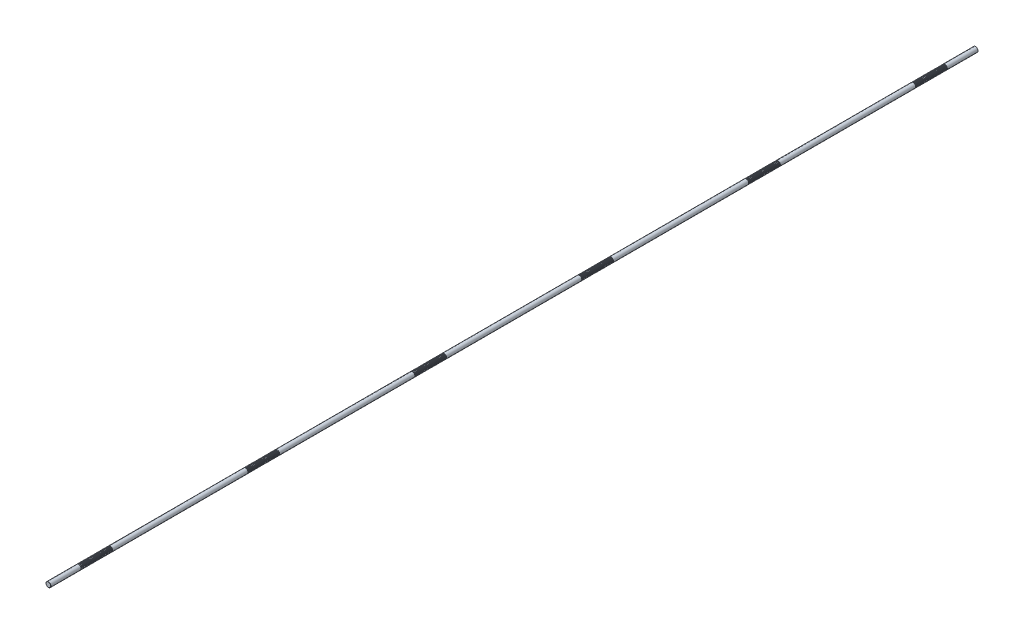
from build123d import *

# Parameters (mm, degrees)
SKETCH1_R           = 8
BOSS_EXTRUDE1_DEPTH = 1500
CHAMFER1_SIZE       = 0.4
LPATTERN1_COUNT     = 26
LPATTERN1_PITCH     = 4
LPATTERN2_COUNT     = 6
LPATTERN2_PITCH     = 540


with BuildPart() as part:
    # Sketch1 → Boss-Extrude1 (new, symmetric)
    with BuildSketch(Plane.XY):
        Circle(SKETCH1_R)
    extrude(amount=BOSS_EXTRUDE1_DEPTH, both=True)

    # Chamfer1
    chamfer1_edges = [part.edges().sort_by_distance(p)[0] for p in [
        (-8, 0, -1500),
        (-8, 0, 1500),
    ]]
    chamfer(chamfer1_edges, length=CHAMFER1_SIZE)

    # Sketch2 → Cut-Revolve1 (revolve, cut)
    with BuildSketch(Plane(origin=(0, 0, 0), x_dir=(0, 0, -1), z_dir=(1, 0, 0)), mode=Mode.PRIVATE) as cut_revolve1_sk:
        Polygon((1400.301442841, 8), (1397.698557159, 8), (1398.301442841, 5.75), (1399.698557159, 5.75), align=None)
    cut_revolve1 = revolve(cut_revolve1_sk.sketch.rotate(Axis((0, 0, 1500), (0, 0, -1)), 90), axis=Axis((0, 0, 1500), (0, 0, -1)), mode=Mode.SUBTRACT)

    # LPattern1: Cut-Revolve1 ×26
    with Locations(*[(0, 0, i * LPATTERN1_PITCH) for i in range(1, LPATTERN1_COUNT)]):
        add(cut_revolve1, mode=Mode.SUBTRACT)

    # LPattern2: Cut-Revolve1 ×6
    with Locations(*[(0, 0, i * LPATTERN2_PITCH) for i in range(1, LPATTERN2_COUNT)]):
        add(cut_revolve1, mode=Mode.SUBTRACT)

    # LPattern2 copy 1 sketch → LPattern2 copy 1 (revolve, cut)
    with BuildSketch(Plane(origin=(0, 0, 544), x_dir=(0, 0, -1), z_dir=(1, 0, 0))):
        Polygon((1400.301442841, 8), (1397.698557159, 8), (1398.301442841, 5.75), (1399.698557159, 5.75), align=None)
    revolve(axis=Axis((0, 0, 2044), (0, 0, -1)), mode=Mode.SUBTRACT)

    # LPattern2 copy 2 sketch → LPattern2 copy 2 (revolve, cut)
    with BuildSketch(Plane(origin=(0, 0, 1084), x_dir=(0, 0, -1), z_dir=(1, 0, 0))):
        Polygon((1400.301442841, 8), (1397.698557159, 8), (1398.301442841, 5.75), (1399.698557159, 5.75), align=None)
    revolve(axis=Axis((0, 0, 2584), (0, 0, -1)), mode=Mode.SUBTRACT)

    # LPattern2 copy 3 sketch → LPattern2 copy 3 (revolve, cut)
    with BuildSketch(Plane(origin=(0, 0, 1624), x_dir=(0, 0, -1), z_dir=(1, 0, 0))):
        Polygon((1400.301442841, 8), (1397.698557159, 8), (1398.301442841, 5.75), (1399.698557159, 5.75), align=None)
    revolve(axis=Axis((0, 0, 3124), (0, 0, -1)), mode=Mode.SUBTRACT)

    # LPattern2 copy 4 sketch → LPattern2 copy 4 (revolve, cut)
    with BuildSketch(Plane(origin=(0, 0, 2164), x_dir=(0, 0, -1), z_dir=(1, 0, 0))):
        Polygon((1400.301442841, 8), (1397.698557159, 8), (1398.301442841, 5.75), (1399.698557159, 5.75), align=None)
    revolve(axis=Axis((0, 0, 3664), (0, 0, -1)), mode=Mode.SUBTRACT)

    # LPattern2 copy 5 sketch → LPattern2 copy 5 (revolve, cut)
    with BuildSketch(Plane(origin=(0, 0, 2704), x_dir=(0, 0, -1), z_dir=(1, 0, 0))):
        Polygon((1400.301442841, 8), (1397.698557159, 8), (1398.301442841, 5.75), (1399.698557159, 5.75), align=None)
    revolve(axis=Axis((0, 0, 4204), (0, 0, -1)), mode=Mode.SUBTRACT)

    # LPattern2 copy 6 sketch → LPattern2 copy 6 (revolve, cut)
    with BuildSketch(Plane(origin=(0, 0, 548), x_dir=(0, 0, -1), z_dir=(1, 0, 0))):
        Polygon((1400.301442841, 8), (1397.698557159, 8), (1398.301442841, 5.75), (1399.698557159, 5.75), align=None)
    revolve(axis=Axis((0, 0, 2048), (0, 0, -1)), mode=Mode.SUBTRACT)

    # LPattern2 copy 7 sketch → LPattern2 copy 7 (revolve, cut)
    with BuildSketch(Plane(origin=(0, 0, 1088), x_dir=(0, 0, -1), z_dir=(1, 0, 0))):
        Polygon((1400.301442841, 8), (1397.698557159, 8), (1398.301442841, 5.75), (1399.698557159, 5.75), align=None)
    revolve(axis=Axis((0, 0, 2588), (0, 0, -1)), mode=Mode.SUBTRACT)

    # LPattern2 copy 8 sketch → LPattern2 copy 8 (revolve, cut)
    with BuildSketch(Plane(origin=(0, 0, 1628), x_dir=(0, 0, -1), z_dir=(1, 0, 0))):
        Polygon((1400.301442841, 8), (1397.698557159, 8), (1398.301442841, 5.75), (1399.698557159, 5.75), align=None)
    revolve(axis=Axis((0, 0, 3128), (0, 0, -1)), mode=Mode.SUBTRACT)

    # LPattern2 copy 9 sketch → LPattern2 copy 9 (revolve, cut)
    with BuildSketch(Plane(origin=(0, 0, 2168), x_dir=(0, 0, -1), z_dir=(1, 0, 0))):
        Polygon((1400.301442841, 8), (1397.698557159, 8), (1398.301442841, 5.75), (1399.698557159, 5.75), align=None)
    revolve(axis=Axis((0, 0, 3668), (0, 0, -1)), mode=Mode.SUBTRACT)

    # LPattern2 copy 10 sketch → LPattern2 copy 10 (revolve, cut)
    with BuildSketch(Plane(origin=(0, 0, 2708), x_dir=(0, 0, -1), z_dir=(1, 0, 0))):
        Polygon((1400.301442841, 8), (1397.698557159, 8), (1398.301442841, 5.75), (1399.698557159, 5.75), align=None)
    revolve(axis=Axis((0, 0, 4208), (0, 0, -1)), mode=Mode.SUBTRACT)

    # LPattern2 copy 11 sketch → LPattern2 copy 11 (revolve, cut)
    with BuildSketch(Plane(origin=(0, 0, 552), x_dir=(0, 0, -1), z_dir=(1, 0, 0))):
        Polygon((1400.301442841, 8), (1397.698557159, 8), (1398.301442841, 5.75), (1399.698557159, 5.75), align=None)
    revolve(axis=Axis((0, 0, 2052), (0, 0, -1)), mode=Mode.SUBTRACT)

    # LPattern2 copy 12 sketch → LPattern2 copy 12 (revolve, cut)
    with BuildSketch(Plane(origin=(0, 0, 1092), x_dir=(0, 0, -1), z_dir=(1, 0, 0))):
        Polygon((1400.301442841, 8), (1397.698557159, 8), (1398.301442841, 5.75), (1399.698557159, 5.75), align=None)
    revolve(axis=Axis((0, 0, 2592), (0, 0, -1)), mode=Mode.SUBTRACT)

    # LPattern2 copy 13 sketch → LPattern2 copy 13 (revolve, cut)
    with BuildSketch(Plane(origin=(0, 0, 1632), x_dir=(0, 0, -1), z_dir=(1, 0, 0))):
        Polygon((1400.301442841, 8), (1397.698557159, 8), (1398.301442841, 5.75), (1399.698557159, 5.75), align=None)
    revolve(axis=Axis((0, 0, 3132), (0, 0, -1)), mode=Mode.SUBTRACT)

    # LPattern2 copy 14 sketch → LPattern2 copy 14 (revolve, cut)
    with BuildSketch(Plane(origin=(0, 0, 2172), x_dir=(0, 0, -1), z_dir=(1, 0, 0))):
        Polygon((1400.301442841, 8), (1397.698557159, 8), (1398.301442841, 5.75), (1399.698557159, 5.75), align=None)
    revolve(axis=Axis((0, 0, 3672), (0, 0, -1)), mode=Mode.SUBTRACT)

    # LPattern2 copy 15 sketch → LPattern2 copy 15 (revolve, cut)
    with BuildSketch(Plane(origin=(0, 0, 2712), x_dir=(0, 0, -1), z_dir=(1, 0, 0))):
        Polygon((1400.301442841, 8), (1397.698557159, 8), (1398.301442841, 5.75), (1399.698557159, 5.75), align=None)
    revolve(axis=Axis((0, 0, 4212), (0, 0, -1)), mode=Mode.SUBTRACT)

    # LPattern2 copy 16 sketch → LPattern2 copy 16 (revolve, cut)
    with BuildSketch(Plane(origin=(0, 0, 556), x_dir=(0, 0, -1), z_dir=(1, 0, 0))):
        Polygon((1400.301442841, 8), (1397.698557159, 8), (1398.301442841, 5.75), (1399.698557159, 5.75), align=None)
    revolve(axis=Axis((0, 0, 2056), (0, 0, -1)), mode=Mode.SUBTRACT)

    # LPattern2 copy 17 sketch → LPattern2 copy 17 (revolve, cut)
    with BuildSketch(Plane(origin=(0, 0, 1096), x_dir=(0, 0, -1), z_dir=(1, 0, 0))):
        Polygon((1400.301442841, 8), (1397.698557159, 8), (1398.301442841, 5.75), (1399.698557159, 5.75), align=None)
    revolve(axis=Axis((0, 0, 2596), (0, 0, -1)), mode=Mode.SUBTRACT)

    # LPattern2 copy 18 sketch → LPattern2 copy 18 (revolve, cut)
    with BuildSketch(Plane(origin=(0, 0, 1636), x_dir=(0, 0, -1), z_dir=(1, 0, 0))):
        Polygon((1400.301442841, 8), (1397.698557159, 8), (1398.301442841, 5.75), (1399.698557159, 5.75), align=None)
    revolve(axis=Axis((0, 0, 3136), (0, 0, -1)), mode=Mode.SUBTRACT)

    # LPattern2 copy 19 sketch → LPattern2 copy 19 (revolve, cut)
    with BuildSketch(Plane(origin=(0, 0, 2176), x_dir=(0, 0, -1), z_dir=(1, 0, 0))):
        Polygon((1400.301442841, 8), (1397.698557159, 8), (1398.301442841, 5.75), (1399.698557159, 5.75), align=None)
    revolve(axis=Axis((0, 0, 3676), (0, 0, -1)), mode=Mode.SUBTRACT)

    # LPattern2 copy 20 sketch → LPattern2 copy 20 (revolve, cut)
    with BuildSketch(Plane(origin=(0, 0, 2716), x_dir=(0, 0, -1), z_dir=(1, 0, 0))):
        Polygon((1400.301442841, 8), (1397.698557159, 8), (1398.301442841, 5.75), (1399.698557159, 5.75), align=None)
    revolve(axis=Axis((0, 0, 4216), (0, 0, -1)), mode=Mode.SUBTRACT)

    # LPattern2 copy 21 sketch → LPattern2 copy 21 (revolve, cut)
    with BuildSketch(Plane(origin=(0, 0, 560), x_dir=(0, 0, -1), z_dir=(1, 0, 0))):
        Polygon((1400.301442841, 8), (1397.698557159, 8), (1398.301442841, 5.75), (1399.698557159, 5.75), align=None)
    revolve(axis=Axis((0, 0, 2060), (0, 0, -1)), mode=Mode.SUBTRACT)

    # LPattern2 copy 22 sketch → LPattern2 copy 22 (revolve, cut)
    with BuildSketch(Plane(origin=(0, 0, 1100), x_dir=(0, 0, -1), z_dir=(1, 0, 0))):
        Polygon((1400.301442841, 8), (1397.698557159, 8), (1398.301442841, 5.75), (1399.698557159, 5.75), align=None)
    revolve(axis=Axis((0, 0, 2600), (0, 0, -1)), mode=Mode.SUBTRACT)

    # LPattern2 copy 23 sketch → LPattern2 copy 23 (revolve, cut)
    with BuildSketch(Plane(origin=(0, 0, 1640), x_dir=(0, 0, -1), z_dir=(1, 0, 0))):
        Polygon((1400.301442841, 8), (1397.698557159, 8), (1398.301442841, 5.75), (1399.698557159, 5.75), align=None)
    revolve(axis=Axis((0, 0, 3140), (0, 0, -1)), mode=Mode.SUBTRACT)

    # LPattern2 copy 24 sketch → LPattern2 copy 24 (revolve, cut)
    with BuildSketch(Plane(origin=(0, 0, 2180), x_dir=(0, 0, -1), z_dir=(1, 0, 0))):
        Polygon((1400.301442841, 8), (1397.698557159, 8), (1398.301442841, 5.75), (1399.698557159, 5.75), align=None)
    revolve(axis=Axis((0, 0, 3680), (0, 0, -1)), mode=Mode.SUBTRACT)

    # LPattern2 copy 25 sketch → LPattern2 copy 25 (revolve, cut)
    with BuildSketch(Plane(origin=(0, 0, 2720), x_dir=(0, 0, -1), z_dir=(1, 0, 0))):
        Polygon((1400.301442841, 8), (1397.698557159, 8), (1398.301442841, 5.75), (1399.698557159, 5.75), align=None)
    revolve(axis=Axis((0, 0, 4220), (0, 0, -1)), mode=Mode.SUBTRACT)

    # LPattern2 copy 26 sketch → LPattern2 copy 26 (revolve, cut)
    with BuildSketch(Plane(origin=(0, 0, 564), x_dir=(0, 0, -1), z_dir=(1, 0, 0))):
        Polygon((1400.301442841, 8), (1397.698557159, 8), (1398.301442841, 5.75), (1399.698557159, 5.75), align=None)
    revolve(axis=Axis((0, 0, 2064), (0, 0, -1)), mode=Mode.SUBTRACT)

    # LPattern2 copy 27 sketch → LPattern2 copy 27 (revolve, cut)
    with BuildSketch(Plane(origin=(0, 0, 1104), x_dir=(0, 0, -1), z_dir=(1, 0, 0))):
        Polygon((1400.301442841, 8), (1397.698557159, 8), (1398.301442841, 5.75), (1399.698557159, 5.75), align=None)
    revolve(axis=Axis((0, 0, 2604), (0, 0, -1)), mode=Mode.SUBTRACT)

    # LPattern2 copy 28 sketch → LPattern2 copy 28 (revolve, cut)
    with BuildSketch(Plane(origin=(0, 0, 1644), x_dir=(0, 0, -1), z_dir=(1, 0, 0))):
        Polygon((1400.301442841, 8), (1397.698557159, 8), (1398.301442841, 5.75), (1399.698557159, 5.75), align=None)
    revolve(axis=Axis((0, 0, 3144), (0, 0, -1)), mode=Mode.SUBTRACT)

    # LPattern2 copy 29 sketch → LPattern2 copy 29 (revolve, cut)
    with BuildSketch(Plane(origin=(0, 0, 2184), x_dir=(0, 0, -1), z_dir=(1, 0, 0))):
        Polygon((1400.301442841, 8), (1397.698557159, 8), (1398.301442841, 5.75), (1399.698557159, 5.75), align=None)
    revolve(axis=Axis((0, 0, 3684), (0, 0, -1)), mode=Mode.SUBTRACT)

    # LPattern2 copy 30 sketch → LPattern2 copy 30 (revolve, cut)
    with BuildSketch(Plane(origin=(0, 0, 2724), x_dir=(0, 0, -1), z_dir=(1, 0, 0))):
        Polygon((1400.301442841, 8), (1397.698557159, 8), (1398.301442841, 5.75), (1399.698557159, 5.75), align=None)
    revolve(axis=Axis((0, 0, 4224), (0, 0, -1)), mode=Mode.SUBTRACT)

    # LPattern2 copy 31 sketch → LPattern2 copy 31 (revolve, cut)
    with BuildSketch(Plane(origin=(0, 0, 568), x_dir=(0, 0, -1), z_dir=(1, 0, 0))):
        Polygon((1400.301442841, 8), (1397.698557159, 8), (1398.301442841, 5.75), (1399.698557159, 5.75), align=None)
    revolve(axis=Axis((0, 0, 2068), (0, 0, -1)), mode=Mode.SUBTRACT)

    # LPattern2 copy 32 sketch → LPattern2 copy 32 (revolve, cut)
    with BuildSketch(Plane(origin=(0, 0, 1108), x_dir=(0, 0, -1), z_dir=(1, 0, 0))):
        Polygon((1400.301442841, 8), (1397.698557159, 8), (1398.301442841, 5.75), (1399.698557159, 5.75), align=None)
    revolve(axis=Axis((0, 0, 2608), (0, 0, -1)), mode=Mode.SUBTRACT)

    # LPattern2 copy 33 sketch → LPattern2 copy 33 (revolve, cut)
    with BuildSketch(Plane(origin=(0, 0, 1648), x_dir=(0, 0, -1), z_dir=(1, 0, 0))):
        Polygon((1400.301442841, 8), (1397.698557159, 8), (1398.301442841, 5.75), (1399.698557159, 5.75), align=None)
    revolve(axis=Axis((0, 0, 3148), (0, 0, -1)), mode=Mode.SUBTRACT)

    # LPattern2 copy 34 sketch → LPattern2 copy 34 (revolve, cut)
    with BuildSketch(Plane(origin=(0, 0, 2188), x_dir=(0, 0, -1), z_dir=(1, 0, 0))):
        Polygon((1400.301442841, 8), (1397.698557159, 8), (1398.301442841, 5.75), (1399.698557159, 5.75), align=None)
    revolve(axis=Axis((0, 0, 3688), (0, 0, -1)), mode=Mode.SUBTRACT)

    # LPattern2 copy 35 sketch → LPattern2 copy 35 (revolve, cut)
    with BuildSketch(Plane(origin=(0, 0, 2728), x_dir=(0, 0, -1), z_dir=(1, 0, 0))):
        Polygon((1400.301442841, 8), (1397.698557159, 8), (1398.301442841, 5.75), (1399.698557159, 5.75), align=None)
    revolve(axis=Axis((0, 0, 4228), (0, 0, -1)), mode=Mode.SUBTRACT)

    # LPattern2 copy 36 sketch → LPattern2 copy 36 (revolve, cut)
    with BuildSketch(Plane(origin=(0, 0, 572), x_dir=(0, 0, -1), z_dir=(1, 0, 0))):
        Polygon((1400.301442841, 8), (1397.698557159, 8), (1398.301442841, 5.75), (1399.698557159, 5.75), align=None)
    revolve(axis=Axis((0, 0, 2072), (0, 0, -1)), mode=Mode.SUBTRACT)

    # LPattern2 copy 37 sketch → LPattern2 copy 37 (revolve, cut)
    with BuildSketch(Plane(origin=(0, 0, 1112), x_dir=(0, 0, -1), z_dir=(1, 0, 0))):
        Polygon((1400.301442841, 8), (1397.698557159, 8), (1398.301442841, 5.75), (1399.698557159, 5.75), align=None)
    revolve(axis=Axis((0, 0, 2612), (0, 0, -1)), mode=Mode.SUBTRACT)

    # LPattern2 copy 38 sketch → LPattern2 copy 38 (revolve, cut)
    with BuildSketch(Plane(origin=(0, 0, 1652), x_dir=(0, 0, -1), z_dir=(1, 0, 0))):
        Polygon((1400.301442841, 8), (1397.698557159, 8), (1398.301442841, 5.75), (1399.698557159, 5.75), align=None)
    revolve(axis=Axis((0, 0, 3152), (0, 0, -1)), mode=Mode.SUBTRACT)

    # LPattern2 copy 39 sketch → LPattern2 copy 39 (revolve, cut)
    with BuildSketch(Plane(origin=(0, 0, 2192), x_dir=(0, 0, -1), z_dir=(1, 0, 0))):
        Polygon((1400.301442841, 8), (1397.698557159, 8), (1398.301442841, 5.75), (1399.698557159, 5.75), align=None)
    revolve(axis=Axis((0, 0, 3692), (0, 0, -1)), mode=Mode.SUBTRACT)

    # LPattern2 copy 40 sketch → LPattern2 copy 40 (revolve, cut)
    with BuildSketch(Plane(origin=(0, 0, 2732), x_dir=(0, 0, -1), z_dir=(1, 0, 0))):
        Polygon((1400.301442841, 8), (1397.698557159, 8), (1398.301442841, 5.75), (1399.698557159, 5.75), align=None)
    revolve(axis=Axis((0, 0, 4232), (0, 0, -1)), mode=Mode.SUBTRACT)

    # LPattern2 copy 41 sketch → LPattern2 copy 41 (revolve, cut)
    with BuildSketch(Plane(origin=(0, 0, 576), x_dir=(0, 0, -1), z_dir=(1, 0, 0))):
        Polygon((1400.301442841, 8), (1397.698557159, 8), (1398.301442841, 5.75), (1399.698557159, 5.75), align=None)
    revolve(axis=Axis((0, 0, 2076), (0, 0, -1)), mode=Mode.SUBTRACT)

    # LPattern2 copy 42 sketch → LPattern2 copy 42 (revolve, cut)
    with BuildSketch(Plane(origin=(0, 0, 1116), x_dir=(0, 0, -1), z_dir=(1, 0, 0))):
        Polygon((1400.301442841, 8), (1397.698557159, 8), (1398.301442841, 5.75), (1399.698557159, 5.75), align=None)
    revolve(axis=Axis((0, 0, 2616), (0, 0, -1)), mode=Mode.SUBTRACT)

    # LPattern2 copy 43 sketch → LPattern2 copy 43 (revolve, cut)
    with BuildSketch(Plane(origin=(0, 0, 1656), x_dir=(0, 0, -1), z_dir=(1, 0, 0))):
        Polygon((1400.301442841, 8), (1397.698557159, 8), (1398.301442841, 5.75), (1399.698557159, 5.75), align=None)
    revolve(axis=Axis((0, 0, 3156), (0, 0, -1)), mode=Mode.SUBTRACT)

    # LPattern2 copy 44 sketch → LPattern2 copy 44 (revolve, cut)
    with BuildSketch(Plane(origin=(0, 0, 2196), x_dir=(0, 0, -1), z_dir=(1, 0, 0))):
        Polygon((1400.301442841, 8), (1397.698557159, 8), (1398.301442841, 5.75), (1399.698557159, 5.75), align=None)
    revolve(axis=Axis((0, 0, 3696), (0, 0, -1)), mode=Mode.SUBTRACT)

    # LPattern2 copy 45 sketch → LPattern2 copy 45 (revolve, cut)
    with BuildSketch(Plane(origin=(0, 0, 2736), x_dir=(0, 0, -1), z_dir=(1, 0, 0))):
        Polygon((1400.301442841, 8), (1397.698557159, 8), (1398.301442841, 5.75), (1399.698557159, 5.75), align=None)
    revolve(axis=Axis((0, 0, 4236), (0, 0, -1)), mode=Mode.SUBTRACT)

    # LPattern2 copy 46 sketch → LPattern2 copy 46 (revolve, cut)
    with BuildSketch(Plane(origin=(0, 0, 580), x_dir=(0, 0, -1), z_dir=(1, 0, 0))):
        Polygon((1400.301442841, 8), (1397.698557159, 8), (1398.301442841, 5.75), (1399.698557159, 5.75), align=None)
    revolve(axis=Axis((0, 0, 2080), (0, 0, -1)), mode=Mode.SUBTRACT)

    # LPattern2 copy 47 sketch → LPattern2 copy 47 (revolve, cut)
    with BuildSketch(Plane(origin=(0, 0, 1120), x_dir=(0, 0, -1), z_dir=(1, 0, 0))):
        Polygon((1400.301442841, 8), (1397.698557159, 8), (1398.301442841, 5.75), (1399.698557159, 5.75), align=None)
    revolve(axis=Axis((0, 0, 2620), (0, 0, -1)), mode=Mode.SUBTRACT)

    # LPattern2 copy 48 sketch → LPattern2 copy 48 (revolve, cut)
    with BuildSketch(Plane(origin=(0, 0, 1660), x_dir=(0, 0, -1), z_dir=(1, 0, 0))):
        Polygon((1400.301442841, 8), (1397.698557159, 8), (1398.301442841, 5.75), (1399.698557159, 5.75), align=None)
    revolve(axis=Axis((0, 0, 3160), (0, 0, -1)), mode=Mode.SUBTRACT)

    # LPattern2 copy 49 sketch → LPattern2 copy 49 (revolve, cut)
    with BuildSketch(Plane(origin=(0, 0, 2200), x_dir=(0, 0, -1), z_dir=(1, 0, 0))):
        Polygon((1400.301442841, 8), (1397.698557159, 8), (1398.301442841, 5.75), (1399.698557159, 5.75), align=None)
    revolve(axis=Axis((0, 0, 3700), (0, 0, -1)), mode=Mode.SUBTRACT)

    # LPattern2 copy 50 sketch → LPattern2 copy 50 (revolve, cut)
    with BuildSketch(Plane(origin=(0, 0, 2740), x_dir=(0, 0, -1), z_dir=(1, 0, 0))):
        Polygon((1400.301442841, 8), (1397.698557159, 8), (1398.301442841, 5.75), (1399.698557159, 5.75), align=None)
    revolve(axis=Axis((0, 0, 4240), (0, 0, -1)), mode=Mode.SUBTRACT)

    # LPattern2 copy 51 sketch → LPattern2 copy 51 (revolve, cut)
    with BuildSketch(Plane(origin=(0, 0, 584), x_dir=(0, 0, -1), z_dir=(1, 0, 0))):
        Polygon((1400.301442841, 8), (1397.698557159, 8), (1398.301442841, 5.75), (1399.698557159, 5.75), align=None)
    revolve(axis=Axis((0, 0, 2084), (0, 0, -1)), mode=Mode.SUBTRACT)

    # LPattern2 copy 52 sketch → LPattern2 copy 52 (revolve, cut)
    with BuildSketch(Plane(origin=(0, 0, 1124), x_dir=(0, 0, -1), z_dir=(1, 0, 0))):
        Polygon((1400.301442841, 8), (1397.698557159, 8), (1398.301442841, 5.75), (1399.698557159, 5.75), align=None)
    revolve(axis=Axis((0, 0, 2624), (0, 0, -1)), mode=Mode.SUBTRACT)

    # LPattern2 copy 53 sketch → LPattern2 copy 53 (revolve, cut)
    with BuildSketch(Plane(origin=(0, 0, 1664), x_dir=(0, 0, -1), z_dir=(1, 0, 0))):
        Polygon((1400.301442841, 8), (1397.698557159, 8), (1398.301442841, 5.75), (1399.698557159, 5.75), align=None)
    revolve(axis=Axis((0, 0, 3164), (0, 0, -1)), mode=Mode.SUBTRACT)

    # LPattern2 copy 54 sketch → LPattern2 copy 54 (revolve, cut)
    with BuildSketch(Plane(origin=(0, 0, 2204), x_dir=(0, 0, -1), z_dir=(1, 0, 0))):
        Polygon((1400.301442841, 8), (1397.698557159, 8), (1398.301442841, 5.75), (1399.698557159, 5.75), align=None)
    revolve(axis=Axis((0, 0, 3704), (0, 0, -1)), mode=Mode.SUBTRACT)

    # LPattern2 copy 55 sketch → LPattern2 copy 55 (revolve, cut)
    with BuildSketch(Plane(origin=(0, 0, 2744), x_dir=(0, 0, -1), z_dir=(1, 0, 0))):
        Polygon((1400.301442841, 8), (1397.698557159, 8), (1398.301442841, 5.75), (1399.698557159, 5.75), align=None)
    revolve(axis=Axis((0, 0, 4244), (0, 0, -1)), mode=Mode.SUBTRACT)

    # LPattern2 copy 56 sketch → LPattern2 copy 56 (revolve, cut)
    with BuildSketch(Plane(origin=(0, 0, 588), x_dir=(0, 0, -1), z_dir=(1, 0, 0))):
        Polygon((1400.301442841, 8), (1397.698557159, 8), (1398.301442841, 5.75), (1399.698557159, 5.75), align=None)
    revolve(axis=Axis((0, 0, 2088), (0, 0, -1)), mode=Mode.SUBTRACT)

    # LPattern2 copy 57 sketch → LPattern2 copy 57 (revolve, cut)
    with BuildSketch(Plane(origin=(0, 0, 1128), x_dir=(0, 0, -1), z_dir=(1, 0, 0))):
        Polygon((1400.301442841, 8), (1397.698557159, 8), (1398.301442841, 5.75), (1399.698557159, 5.75), align=None)
    revolve(axis=Axis((0, 0, 2628), (0, 0, -1)), mode=Mode.SUBTRACT)

    # LPattern2 copy 58 sketch → LPattern2 copy 58 (revolve, cut)
    with BuildSketch(Plane(origin=(0, 0, 1668), x_dir=(0, 0, -1), z_dir=(1, 0, 0))):
        Polygon((1400.301442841, 8), (1397.698557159, 8), (1398.301442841, 5.75), (1399.698557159, 5.75), align=None)
    revolve(axis=Axis((0, 0, 3168), (0, 0, -1)), mode=Mode.SUBTRACT)

    # LPattern2 copy 59 sketch → LPattern2 copy 59 (revolve, cut)
    with BuildSketch(Plane(origin=(0, 0, 2208), x_dir=(0, 0, -1), z_dir=(1, 0, 0))):
        Polygon((1400.301442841, 8), (1397.698557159, 8), (1398.301442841, 5.75), (1399.698557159, 5.75), align=None)
    revolve(axis=Axis((0, 0, 3708), (0, 0, -1)), mode=Mode.SUBTRACT)

    # LPattern2 copy 60 sketch → LPattern2 copy 60 (revolve, cut)
    with BuildSketch(Plane(origin=(0, 0, 2748), x_dir=(0, 0, -1), z_dir=(1, 0, 0))):
        Polygon((1400.301442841, 8), (1397.698557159, 8), (1398.301442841, 5.75), (1399.698557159, 5.75), align=None)
    revolve(axis=Axis((0, 0, 4248), (0, 0, -1)), mode=Mode.SUBTRACT)

    # LPattern2 copy 61 sketch → LPattern2 copy 61 (revolve, cut)
    with BuildSketch(Plane(origin=(0, 0, 592), x_dir=(0, 0, -1), z_dir=(1, 0, 0))):
        Polygon((1400.301442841, 8), (1397.698557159, 8), (1398.301442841, 5.75), (1399.698557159, 5.75), align=None)
    revolve(axis=Axis((0, 0, 2092), (0, 0, -1)), mode=Mode.SUBTRACT)

    # LPattern2 copy 62 sketch → LPattern2 copy 62 (revolve, cut)
    with BuildSketch(Plane(origin=(0, 0, 1132), x_dir=(0, 0, -1), z_dir=(1, 0, 0))):
        Polygon((1400.301442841, 8), (1397.698557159, 8), (1398.301442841, 5.75), (1399.698557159, 5.75), align=None)
    revolve(axis=Axis((0, 0, 2632), (0, 0, -1)), mode=Mode.SUBTRACT)

    # LPattern2 copy 63 sketch → LPattern2 copy 63 (revolve, cut)
    with BuildSketch(Plane(origin=(0, 0, 1672), x_dir=(0, 0, -1), z_dir=(1, 0, 0))):
        Polygon((1400.301442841, 8), (1397.698557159, 8), (1398.301442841, 5.75), (1399.698557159, 5.75), align=None)
    revolve(axis=Axis((0, 0, 3172), (0, 0, -1)), mode=Mode.SUBTRACT)

    # LPattern2 copy 64 sketch → LPattern2 copy 64 (revolve, cut)
    with BuildSketch(Plane(origin=(0, 0, 2212), x_dir=(0, 0, -1), z_dir=(1, 0, 0))):
        Polygon((1400.301442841, 8), (1397.698557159, 8), (1398.301442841, 5.75), (1399.698557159, 5.75), align=None)
    revolve(axis=Axis((0, 0, 3712), (0, 0, -1)), mode=Mode.SUBTRACT)

    # LPattern2 copy 65 sketch → LPattern2 copy 65 (revolve, cut)
    with BuildSketch(Plane(origin=(0, 0, 2752), x_dir=(0, 0, -1), z_dir=(1, 0, 0))):
        Polygon((1400.301442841, 8), (1397.698557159, 8), (1398.301442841, 5.75), (1399.698557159, 5.75), align=None)
    revolve(axis=Axis((0, 0, 4252), (0, 0, -1)), mode=Mode.SUBTRACT)

    # LPattern2 copy 66 sketch → LPattern2 copy 66 (revolve, cut)
    with BuildSketch(Plane(origin=(0, 0, 596), x_dir=(0, 0, -1), z_dir=(1, 0, 0))):
        Polygon((1400.301442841, 8), (1397.698557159, 8), (1398.301442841, 5.75), (1399.698557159, 5.75), align=None)
    revolve(axis=Axis((0, 0, 2096), (0, 0, -1)), mode=Mode.SUBTRACT)

    # LPattern2 copy 67 sketch → LPattern2 copy 67 (revolve, cut)
    with BuildSketch(Plane(origin=(0, 0, 1136), x_dir=(0, 0, -1), z_dir=(1, 0, 0))):
        Polygon((1400.301442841, 8), (1397.698557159, 8), (1398.301442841, 5.75), (1399.698557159, 5.75), align=None)
    revolve(axis=Axis((0, 0, 2636), (0, 0, -1)), mode=Mode.SUBTRACT)

    # LPattern2 copy 68 sketch → LPattern2 copy 68 (revolve, cut)
    with BuildSketch(Plane(origin=(0, 0, 1676), x_dir=(0, 0, -1), z_dir=(1, 0, 0))):
        Polygon((1400.301442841, 8), (1397.698557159, 8), (1398.301442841, 5.75), (1399.698557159, 5.75), align=None)
    revolve(axis=Axis((0, 0, 3176), (0, 0, -1)), mode=Mode.SUBTRACT)

    # LPattern2 copy 69 sketch → LPattern2 copy 69 (revolve, cut)
    with BuildSketch(Plane(origin=(0, 0, 2216), x_dir=(0, 0, -1), z_dir=(1, 0, 0))):
        Polygon((1400.301442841, 8), (1397.698557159, 8), (1398.301442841, 5.75), (1399.698557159, 5.75), align=None)
    revolve(axis=Axis((0, 0, 3716), (0, 0, -1)), mode=Mode.SUBTRACT)

    # LPattern2 copy 70 sketch → LPattern2 copy 70 (revolve, cut)
    with BuildSketch(Plane(origin=(0, 0, 2756), x_dir=(0, 0, -1), z_dir=(1, 0, 0))):
        Polygon((1400.301442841, 8), (1397.698557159, 8), (1398.301442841, 5.75), (1399.698557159, 5.75), align=None)
    revolve(axis=Axis((0, 0, 4256), (0, 0, -1)), mode=Mode.SUBTRACT)

    # LPattern2 copy 71 sketch → LPattern2 copy 71 (revolve, cut)
    with BuildSketch(Plane(origin=(0, 0, 600), x_dir=(0, 0, -1), z_dir=(1, 0, 0))):
        Polygon((1400.301442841, 8), (1397.698557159, 8), (1398.301442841, 5.75), (1399.698557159, 5.75), align=None)
    revolve(axis=Axis((0, 0, 2100), (0, 0, -1)), mode=Mode.SUBTRACT)

    # LPattern2 copy 72 sketch → LPattern2 copy 72 (revolve, cut)
    with BuildSketch(Plane(origin=(0, 0, 1140), x_dir=(0, 0, -1), z_dir=(1, 0, 0))):
        Polygon((1400.301442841, 8), (1397.698557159, 8), (1398.301442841, 5.75), (1399.698557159, 5.75), align=None)
    revolve(axis=Axis((0, 0, 2640), (0, 0, -1)), mode=Mode.SUBTRACT)

    # LPattern2 copy 73 sketch → LPattern2 copy 73 (revolve, cut)
    with BuildSketch(Plane(origin=(0, 0, 1680), x_dir=(0, 0, -1), z_dir=(1, 0, 0))):
        Polygon((1400.301442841, 8), (1397.698557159, 8), (1398.301442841, 5.75), (1399.698557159, 5.75), align=None)
    revolve(axis=Axis((0, 0, 3180), (0, 0, -1)), mode=Mode.SUBTRACT)

    # LPattern2 copy 74 sketch → LPattern2 copy 74 (revolve, cut)
    with BuildSketch(Plane(origin=(0, 0, 2220), x_dir=(0, 0, -1), z_dir=(1, 0, 0))):
        Polygon((1400.301442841, 8), (1397.698557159, 8), (1398.301442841, 5.75), (1399.698557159, 5.75), align=None)
    revolve(axis=Axis((0, 0, 3720), (0, 0, -1)), mode=Mode.SUBTRACT)

    # LPattern2 copy 75 sketch → LPattern2 copy 75 (revolve, cut)
    with BuildSketch(Plane(origin=(0, 0, 2760), x_dir=(0, 0, -1), z_dir=(1, 0, 0))):
        Polygon((1400.301442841, 8), (1397.698557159, 8), (1398.301442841, 5.75), (1399.698557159, 5.75), align=None)
    revolve(axis=Axis((0, 0, 4260), (0, 0, -1)), mode=Mode.SUBTRACT)

    # LPattern2 copy 76 sketch → LPattern2 copy 76 (revolve, cut)
    with BuildSketch(Plane(origin=(0, 0, 604), x_dir=(0, 0, -1), z_dir=(1, 0, 0))):
        Polygon((1400.301442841, 8), (1397.698557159, 8), (1398.301442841, 5.75), (1399.698557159, 5.75), align=None)
    revolve(axis=Axis((0, 0, 2104), (0, 0, -1)), mode=Mode.SUBTRACT)

    # LPattern2 copy 77 sketch → LPattern2 copy 77 (revolve, cut)
    with BuildSketch(Plane(origin=(0, 0, 1144), x_dir=(0, 0, -1), z_dir=(1, 0, 0))):
        Polygon((1400.301442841, 8), (1397.698557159, 8), (1398.301442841, 5.75), (1399.698557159, 5.75), align=None)
    revolve(axis=Axis((0, 0, 2644), (0, 0, -1)), mode=Mode.SUBTRACT)

    # LPattern2 copy 78 sketch → LPattern2 copy 78 (revolve, cut)
    with BuildSketch(Plane(origin=(0, 0, 1684), x_dir=(0, 0, -1), z_dir=(1, 0, 0))):
        Polygon((1400.301442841, 8), (1397.698557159, 8), (1398.301442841, 5.75), (1399.698557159, 5.75), align=None)
    revolve(axis=Axis((0, 0, 3184), (0, 0, -1)), mode=Mode.SUBTRACT)

    # LPattern2 copy 79 sketch → LPattern2 copy 79 (revolve, cut)
    with BuildSketch(Plane(origin=(0, 0, 2224), x_dir=(0, 0, -1), z_dir=(1, 0, 0))):
        Polygon((1400.301442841, 8), (1397.698557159, 8), (1398.301442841, 5.75), (1399.698557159, 5.75), align=None)
    revolve(axis=Axis((0, 0, 3724), (0, 0, -1)), mode=Mode.SUBTRACT)

    # LPattern2 copy 80 sketch → LPattern2 copy 80 (revolve, cut)
    with BuildSketch(Plane(origin=(0, 0, 2764), x_dir=(0, 0, -1), z_dir=(1, 0, 0))):
        Polygon((1400.301442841, 8), (1397.698557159, 8), (1398.301442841, 5.75), (1399.698557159, 5.75), align=None)
    revolve(axis=Axis((0, 0, 4264), (0, 0, -1)), mode=Mode.SUBTRACT)

    # LPattern2 copy 81 sketch → LPattern2 copy 81 (revolve, cut)
    with BuildSketch(Plane(origin=(0, 0, 608), x_dir=(0, 0, -1), z_dir=(1, 0, 0))):
        Polygon((1400.301442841, 8), (1397.698557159, 8), (1398.301442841, 5.75), (1399.698557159, 5.75), align=None)
    revolve(axis=Axis((0, 0, 2108), (0, 0, -1)), mode=Mode.SUBTRACT)

    # LPattern2 copy 82 sketch → LPattern2 copy 82 (revolve, cut)
    with BuildSketch(Plane(origin=(0, 0, 1148), x_dir=(0, 0, -1), z_dir=(1, 0, 0))):
        Polygon((1400.301442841, 8), (1397.698557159, 8), (1398.301442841, 5.75), (1399.698557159, 5.75), align=None)
    revolve(axis=Axis((0, 0, 2648), (0, 0, -1)), mode=Mode.SUBTRACT)

    # LPattern2 copy 83 sketch → LPattern2 copy 83 (revolve, cut)
    with BuildSketch(Plane(origin=(0, 0, 1688), x_dir=(0, 0, -1), z_dir=(1, 0, 0))):
        Polygon((1400.301442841, 8), (1397.698557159, 8), (1398.301442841, 5.75), (1399.698557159, 5.75), align=None)
    revolve(axis=Axis((0, 0, 3188), (0, 0, -1)), mode=Mode.SUBTRACT)

    # LPattern2 copy 84 sketch → LPattern2 copy 84 (revolve, cut)
    with BuildSketch(Plane(origin=(0, 0, 2228), x_dir=(0, 0, -1), z_dir=(1, 0, 0))):
        Polygon((1400.301442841, 8), (1397.698557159, 8), (1398.301442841, 5.75), (1399.698557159, 5.75), align=None)
    revolve(axis=Axis((0, 0, 3728), (0, 0, -1)), mode=Mode.SUBTRACT)

    # LPattern2 copy 85 sketch → LPattern2 copy 85 (revolve, cut)
    with BuildSketch(Plane(origin=(0, 0, 2768), x_dir=(0, 0, -1), z_dir=(1, 0, 0))):
        Polygon((1400.301442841, 8), (1397.698557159, 8), (1398.301442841, 5.75), (1399.698557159, 5.75), align=None)
    revolve(axis=Axis((0, 0, 4268), (0, 0, -1)), mode=Mode.SUBTRACT)

    # LPattern2 copy 86 sketch → LPattern2 copy 86 (revolve, cut)
    with BuildSketch(Plane(origin=(0, 0, 612), x_dir=(0, 0, -1), z_dir=(1, 0, 0))):
        Polygon((1400.301442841, 8), (1397.698557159, 8), (1398.301442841, 5.75), (1399.698557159, 5.75), align=None)
    revolve(axis=Axis((0, 0, 2112), (0, 0, -1)), mode=Mode.SUBTRACT)

    # LPattern2 copy 87 sketch → LPattern2 copy 87 (revolve, cut)
    with BuildSketch(Plane(origin=(0, 0, 1152), x_dir=(0, 0, -1), z_dir=(1, 0, 0))):
        Polygon((1400.301442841, 8), (1397.698557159, 8), (1398.301442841, 5.75), (1399.698557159, 5.75), align=None)
    revolve(axis=Axis((0, 0, 2652), (0, 0, -1)), mode=Mode.SUBTRACT)

    # LPattern2 copy 88 sketch → LPattern2 copy 88 (revolve, cut)
    with BuildSketch(Plane(origin=(0, 0, 1692), x_dir=(0, 0, -1), z_dir=(1, 0, 0))):
        Polygon((1400.301442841, 8), (1397.698557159, 8), (1398.301442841, 5.75), (1399.698557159, 5.75), align=None)
    revolve(axis=Axis((0, 0, 3192), (0, 0, -1)), mode=Mode.SUBTRACT)

    # LPattern2 copy 89 sketch → LPattern2 copy 89 (revolve, cut)
    with BuildSketch(Plane(origin=(0, 0, 2232), x_dir=(0, 0, -1), z_dir=(1, 0, 0))):
        Polygon((1400.301442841, 8), (1397.698557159, 8), (1398.301442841, 5.75), (1399.698557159, 5.75), align=None)
    revolve(axis=Axis((0, 0, 3732), (0, 0, -1)), mode=Mode.SUBTRACT)

    # LPattern2 copy 90 sketch → LPattern2 copy 90 (revolve, cut)
    with BuildSketch(Plane(origin=(0, 0, 2772), x_dir=(0, 0, -1), z_dir=(1, 0, 0))):
        Polygon((1400.301442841, 8), (1397.698557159, 8), (1398.301442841, 5.75), (1399.698557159, 5.75), align=None)
    revolve(axis=Axis((0, 0, 4272), (0, 0, -1)), mode=Mode.SUBTRACT)

    # LPattern2 copy 91 sketch → LPattern2 copy 91 (revolve, cut)
    with BuildSketch(Plane(origin=(0, 0, 616), x_dir=(0, 0, -1), z_dir=(1, 0, 0))):
        Polygon((1400.301442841, 8), (1397.698557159, 8), (1398.301442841, 5.75), (1399.698557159, 5.75), align=None)
    revolve(axis=Axis((0, 0, 2116), (0, 0, -1)), mode=Mode.SUBTRACT)

    # LPattern2 copy 92 sketch → LPattern2 copy 92 (revolve, cut)
    with BuildSketch(Plane(origin=(0, 0, 1156), x_dir=(0, 0, -1), z_dir=(1, 0, 0))):
        Polygon((1400.301442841, 8), (1397.698557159, 8), (1398.301442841, 5.75), (1399.698557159, 5.75), align=None)
    revolve(axis=Axis((0, 0, 2656), (0, 0, -1)), mode=Mode.SUBTRACT)

    # LPattern2 copy 93 sketch → LPattern2 copy 93 (revolve, cut)
    with BuildSketch(Plane(origin=(0, 0, 1696), x_dir=(0, 0, -1), z_dir=(1, 0, 0))):
        Polygon((1400.301442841, 8), (1397.698557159, 8), (1398.301442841, 5.75), (1399.698557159, 5.75), align=None)
    revolve(axis=Axis((0, 0, 3196), (0, 0, -1)), mode=Mode.SUBTRACT)

    # LPattern2 copy 94 sketch → LPattern2 copy 94 (revolve, cut)
    with BuildSketch(Plane(origin=(0, 0, 2236), x_dir=(0, 0, -1), z_dir=(1, 0, 0))):
        Polygon((1400.301442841, 8), (1397.698557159, 8), (1398.301442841, 5.75), (1399.698557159, 5.75), align=None)
    revolve(axis=Axis((0, 0, 3736), (0, 0, -1)), mode=Mode.SUBTRACT)

    # LPattern2 copy 95 sketch → LPattern2 copy 95 (revolve, cut)
    with BuildSketch(Plane(origin=(0, 0, 2776), x_dir=(0, 0, -1), z_dir=(1, 0, 0))):
        Polygon((1400.301442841, 8), (1397.698557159, 8), (1398.301442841, 5.75), (1399.698557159, 5.75), align=None)
    revolve(axis=Axis((0, 0, 4276), (0, 0, -1)), mode=Mode.SUBTRACT)

    # LPattern2 copy 96 sketch → LPattern2 copy 96 (revolve, cut)
    with BuildSketch(Plane(origin=(0, 0, 620), x_dir=(0, 0, -1), z_dir=(1, 0, 0))):
        Polygon((1400.301442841, 8), (1397.698557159, 8), (1398.301442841, 5.75), (1399.698557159, 5.75), align=None)
    revolve(axis=Axis((0, 0, 2120), (0, 0, -1)), mode=Mode.SUBTRACT)

    # LPattern2 copy 97 sketch → LPattern2 copy 97 (revolve, cut)
    with BuildSketch(Plane(origin=(0, 0, 1160), x_dir=(0, 0, -1), z_dir=(1, 0, 0))):
        Polygon((1400.301442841, 8), (1397.698557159, 8), (1398.301442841, 5.75), (1399.698557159, 5.75), align=None)
    revolve(axis=Axis((0, 0, 2660), (0, 0, -1)), mode=Mode.SUBTRACT)

    # LPattern2 copy 98 sketch → LPattern2 copy 98 (revolve, cut)
    with BuildSketch(Plane(origin=(0, 0, 1700), x_dir=(0, 0, -1), z_dir=(1, 0, 0))):
        Polygon((1400.301442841, 8), (1397.698557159, 8), (1398.301442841, 5.75), (1399.698557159, 5.75), align=None)
    revolve(axis=Axis((0, 0, 3200), (0, 0, -1)), mode=Mode.SUBTRACT)

    # LPattern2 copy 99 sketch → LPattern2 copy 99 (revolve, cut)
    with BuildSketch(Plane(origin=(0, 0, 2240), x_dir=(0, 0, -1), z_dir=(1, 0, 0))):
        Polygon((1400.301442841, 8), (1397.698557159, 8), (1398.301442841, 5.75), (1399.698557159, 5.75), align=None)
    revolve(axis=Axis((0, 0, 3740), (0, 0, -1)), mode=Mode.SUBTRACT)

    # LPattern2 copy 100 sketch → LPattern2 copy 100 (revolve, cut)
    with BuildSketch(Plane(origin=(0, 0, 2780), x_dir=(0, 0, -1), z_dir=(1, 0, 0))):
        Polygon((1400.301442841, 8), (1397.698557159, 8), (1398.301442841, 5.75), (1399.698557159, 5.75), align=None)
    revolve(axis=Axis((0, 0, 4280), (0, 0, -1)), mode=Mode.SUBTRACT)

    # LPattern2 copy 101 sketch → LPattern2 copy 101 (revolve, cut)
    with BuildSketch(Plane(origin=(0, 0, 624), x_dir=(0, 0, -1), z_dir=(1, 0, 0))):
        Polygon((1400.301442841, 8), (1397.698557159, 8), (1398.301442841, 5.75), (1399.698557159, 5.75), align=None)
    revolve(axis=Axis((0, 0, 2124), (0, 0, -1)), mode=Mode.SUBTRACT)

    # LPattern2 copy 102 sketch → LPattern2 copy 102 (revolve, cut)
    with BuildSketch(Plane(origin=(0, 0, 1164), x_dir=(0, 0, -1), z_dir=(1, 0, 0))):
        Polygon((1400.301442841, 8), (1397.698557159, 8), (1398.301442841, 5.75), (1399.698557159, 5.75), align=None)
    revolve(axis=Axis((0, 0, 2664), (0, 0, -1)), mode=Mode.SUBTRACT)

    # LPattern2 copy 103 sketch → LPattern2 copy 103 (revolve, cut)
    with BuildSketch(Plane(origin=(0, 0, 1704), x_dir=(0, 0, -1), z_dir=(1, 0, 0))):
        Polygon((1400.301442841, 8), (1397.698557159, 8), (1398.301442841, 5.75), (1399.698557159, 5.75), align=None)
    revolve(axis=Axis((0, 0, 3204), (0, 0, -1)), mode=Mode.SUBTRACT)

    # LPattern2 copy 104 sketch → LPattern2 copy 104 (revolve, cut)
    with BuildSketch(Plane(origin=(0, 0, 2244), x_dir=(0, 0, -1), z_dir=(1, 0, 0))):
        Polygon((1400.301442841, 8), (1397.698557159, 8), (1398.301442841, 5.75), (1399.698557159, 5.75), align=None)
    revolve(axis=Axis((0, 0, 3744), (0, 0, -1)), mode=Mode.SUBTRACT)

    # LPattern2 copy 105 sketch → LPattern2 copy 105 (revolve, cut)
    with BuildSketch(Plane(origin=(0, 0, 2784), x_dir=(0, 0, -1), z_dir=(1, 0, 0))):
        Polygon((1400.301442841, 8), (1397.698557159, 8), (1398.301442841, 5.75), (1399.698557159, 5.75), align=None)
    revolve(axis=Axis((0, 0, 4284), (0, 0, -1)), mode=Mode.SUBTRACT)

    # LPattern2 copy 106 sketch → LPattern2 copy 106 (revolve, cut)
    with BuildSketch(Plane(origin=(0, 0, 628), x_dir=(0, 0, -1), z_dir=(1, 0, 0))):
        Polygon((1400.301442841, 8), (1397.698557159, 8), (1398.301442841, 5.75), (1399.698557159, 5.75), align=None)
    revolve(axis=Axis((0, 0, 2128), (0, 0, -1)), mode=Mode.SUBTRACT)

    # LPattern2 copy 107 sketch → LPattern2 copy 107 (revolve, cut)
    with BuildSketch(Plane(origin=(0, 0, 1168), x_dir=(0, 0, -1), z_dir=(1, 0, 0))):
        Polygon((1400.301442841, 8), (1397.698557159, 8), (1398.301442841, 5.75), (1399.698557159, 5.75), align=None)
    revolve(axis=Axis((0, 0, 2668), (0, 0, -1)), mode=Mode.SUBTRACT)

    # LPattern2 copy 108 sketch → LPattern2 copy 108 (revolve, cut)
    with BuildSketch(Plane(origin=(0, 0, 1708), x_dir=(0, 0, -1), z_dir=(1, 0, 0))):
        Polygon((1400.301442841, 8), (1397.698557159, 8), (1398.301442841, 5.75), (1399.698557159, 5.75), align=None)
    revolve(axis=Axis((0, 0, 3208), (0, 0, -1)), mode=Mode.SUBTRACT)

    # LPattern2 copy 109 sketch → LPattern2 copy 109 (revolve, cut)
    with BuildSketch(Plane(origin=(0, 0, 2248), x_dir=(0, 0, -1), z_dir=(1, 0, 0))):
        Polygon((1400.301442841, 8), (1397.698557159, 8), (1398.301442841, 5.75), (1399.698557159, 5.75), align=None)
    revolve(axis=Axis((0, 0, 3748), (0, 0, -1)), mode=Mode.SUBTRACT)

    # LPattern2 copy 110 sketch → LPattern2 copy 110 (revolve, cut)
    with BuildSketch(Plane(origin=(0, 0, 2788), x_dir=(0, 0, -1), z_dir=(1, 0, 0))):
        Polygon((1400.301442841, 8), (1397.698557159, 8), (1398.301442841, 5.75), (1399.698557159, 5.75), align=None)
    revolve(axis=Axis((0, 0, 4288), (0, 0, -1)), mode=Mode.SUBTRACT)

    # LPattern2 copy 111 sketch → LPattern2 copy 111 (revolve, cut)
    with BuildSketch(Plane(origin=(0, 0, 632), x_dir=(0, 0, -1), z_dir=(1, 0, 0))):
        Polygon((1400.301442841, 8), (1397.698557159, 8), (1398.301442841, 5.75), (1399.698557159, 5.75), align=None)
    revolve(axis=Axis((0, 0, 2132), (0, 0, -1)), mode=Mode.SUBTRACT)

    # LPattern2 copy 112 sketch → LPattern2 copy 112 (revolve, cut)
    with BuildSketch(Plane(origin=(0, 0, 1172), x_dir=(0, 0, -1), z_dir=(1, 0, 0))):
        Polygon((1400.301442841, 8), (1397.698557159, 8), (1398.301442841, 5.75), (1399.698557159, 5.75), align=None)
    revolve(axis=Axis((0, 0, 2672), (0, 0, -1)), mode=Mode.SUBTRACT)

    # LPattern2 copy 113 sketch → LPattern2 copy 113 (revolve, cut)
    with BuildSketch(Plane(origin=(0, 0, 1712), x_dir=(0, 0, -1), z_dir=(1, 0, 0))):
        Polygon((1400.301442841, 8), (1397.698557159, 8), (1398.301442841, 5.75), (1399.698557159, 5.75), align=None)
    revolve(axis=Axis((0, 0, 3212), (0, 0, -1)), mode=Mode.SUBTRACT)

    # LPattern2 copy 114 sketch → LPattern2 copy 114 (revolve, cut)
    with BuildSketch(Plane(origin=(0, 0, 2252), x_dir=(0, 0, -1), z_dir=(1, 0, 0))):
        Polygon((1400.301442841, 8), (1397.698557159, 8), (1398.301442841, 5.75), (1399.698557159, 5.75), align=None)
    revolve(axis=Axis((0, 0, 3752), (0, 0, -1)), mode=Mode.SUBTRACT)

    # LPattern2 copy 115 sketch → LPattern2 copy 115 (revolve, cut)
    with BuildSketch(Plane(origin=(0, 0, 2792), x_dir=(0, 0, -1), z_dir=(1, 0, 0))):
        Polygon((1400.301442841, 8), (1397.698557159, 8), (1398.301442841, 5.75), (1399.698557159, 5.75), align=None)
    revolve(axis=Axis((0, 0, 4292), (0, 0, -1)), mode=Mode.SUBTRACT)

    # LPattern2 copy 116 sketch → LPattern2 copy 116 (revolve, cut)
    with BuildSketch(Plane(origin=(0, 0, 636), x_dir=(0, 0, -1), z_dir=(1, 0, 0))):
        Polygon((1400.301442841, 8), (1397.698557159, 8), (1398.301442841, 5.75), (1399.698557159, 5.75), align=None)
    revolve(axis=Axis((0, 0, 2136), (0, 0, -1)), mode=Mode.SUBTRACT)

    # LPattern2 copy 117 sketch → LPattern2 copy 117 (revolve, cut)
    with BuildSketch(Plane(origin=(0, 0, 1176), x_dir=(0, 0, -1), z_dir=(1, 0, 0))):
        Polygon((1400.301442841, 8), (1397.698557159, 8), (1398.301442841, 5.75), (1399.698557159, 5.75), align=None)
    revolve(axis=Axis((0, 0, 2676), (0, 0, -1)), mode=Mode.SUBTRACT)

    # LPattern2 copy 118 sketch → LPattern2 copy 118 (revolve, cut)
    with BuildSketch(Plane(origin=(0, 0, 1716), x_dir=(0, 0, -1), z_dir=(1, 0, 0))):
        Polygon((1400.301442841, 8), (1397.698557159, 8), (1398.301442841, 5.75), (1399.698557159, 5.75), align=None)
    revolve(axis=Axis((0, 0, 3216), (0, 0, -1)), mode=Mode.SUBTRACT)

    # LPattern2 copy 119 sketch → LPattern2 copy 119 (revolve, cut)
    with BuildSketch(Plane(origin=(0, 0, 2256), x_dir=(0, 0, -1), z_dir=(1, 0, 0))):
        Polygon((1400.301442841, 8), (1397.698557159, 8), (1398.301442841, 5.75), (1399.698557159, 5.75), align=None)
    revolve(axis=Axis((0, 0, 3756), (0, 0, -1)), mode=Mode.SUBTRACT)

    # LPattern2 copy 120 sketch → LPattern2 copy 120 (revolve, cut)
    with BuildSketch(Plane(origin=(0, 0, 2796), x_dir=(0, 0, -1), z_dir=(1, 0, 0))):
        Polygon((1400.301442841, 8), (1397.698557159, 8), (1398.301442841, 5.75), (1399.698557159, 5.75), align=None)
    revolve(axis=Axis((0, 0, 4296), (0, 0, -1)), mode=Mode.SUBTRACT)

    # LPattern2 copy 121 sketch → LPattern2 copy 121 (revolve, cut)
    with BuildSketch(Plane(origin=(0, 0, 640), x_dir=(0, 0, -1), z_dir=(1, 0, 0))):
        Polygon((1400.301442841, 8), (1397.698557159, 8), (1398.301442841, 5.75), (1399.698557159, 5.75), align=None)
    revolve(axis=Axis((0, 0, 2140), (0, 0, -1)), mode=Mode.SUBTRACT)

    # LPattern2 copy 122 sketch → LPattern2 copy 122 (revolve, cut)
    with BuildSketch(Plane(origin=(0, 0, 1180), x_dir=(0, 0, -1), z_dir=(1, 0, 0))):
        Polygon((1400.301442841, 8), (1397.698557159, 8), (1398.301442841, 5.75), (1399.698557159, 5.75), align=None)
    revolve(axis=Axis((0, 0, 2680), (0, 0, -1)), mode=Mode.SUBTRACT)

    # LPattern2 copy 123 sketch → LPattern2 copy 123 (revolve, cut)
    with BuildSketch(Plane(origin=(0, 0, 1720), x_dir=(0, 0, -1), z_dir=(1, 0, 0))):
        Polygon((1400.301442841, 8), (1397.698557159, 8), (1398.301442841, 5.75), (1399.698557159, 5.75), align=None)
    revolve(axis=Axis((0, 0, 3220), (0, 0, -1)), mode=Mode.SUBTRACT)

    # LPattern2 copy 124 sketch → LPattern2 copy 124 (revolve, cut)
    with BuildSketch(Plane(origin=(0, 0, 2260), x_dir=(0, 0, -1), z_dir=(1, 0, 0))):
        Polygon((1400.301442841, 8), (1397.698557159, 8), (1398.301442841, 5.75), (1399.698557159, 5.75), align=None)
    revolve(axis=Axis((0, 0, 3760), (0, 0, -1)), mode=Mode.SUBTRACT)

    # LPattern2 copy 125 sketch → LPattern2 copy 125 (revolve, cut)
    with BuildSketch(Plane(origin=(0, 0, 2800), x_dir=(0, 0, -1), z_dir=(1, 0, 0))):
        Polygon((1400.301442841, 8), (1397.698557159, 8), (1398.301442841, 5.75), (1399.698557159, 5.75), align=None)
    revolve(axis=Axis((0, 0, 4300), (0, 0, -1)), mode=Mode.SUBTRACT)


solid = part.part
